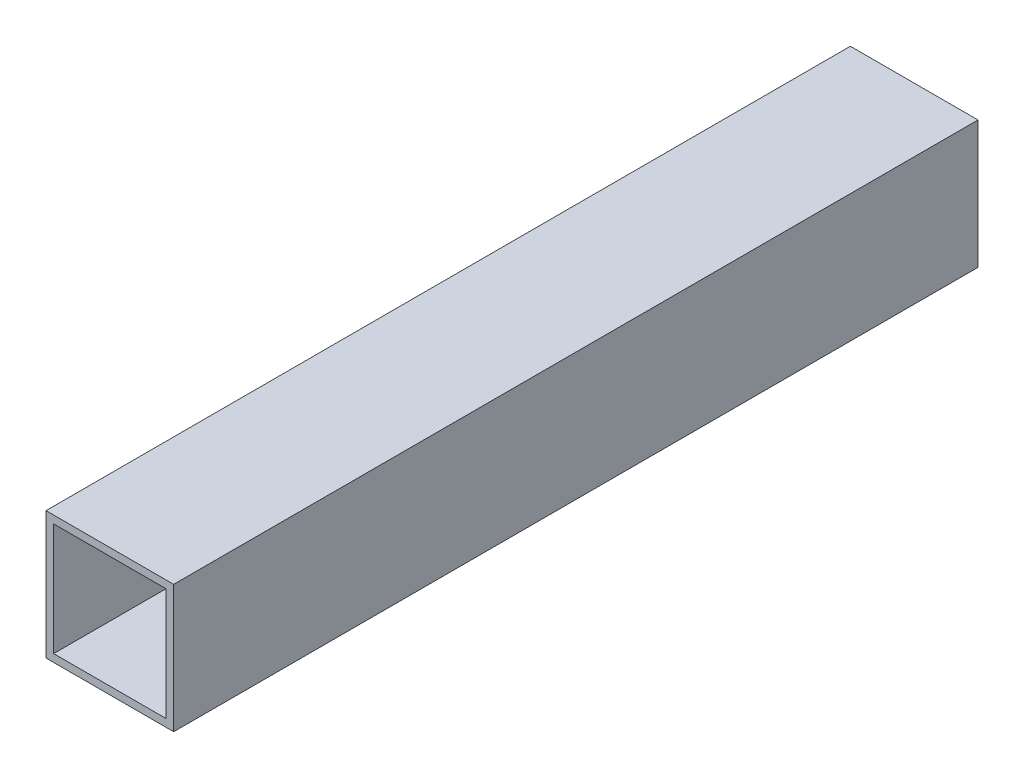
ISO-10303-21;
HEADER;
FILE_DESCRIPTION(('STEP AP214'),'2;1');
FILE_NAME('part.step','',(''),(''),'','','');
FILE_SCHEMA(('AUTOMOTIVE_DESIGN { 1 0 10303 214 1 1 1 1 }'));
ENDSEC;
DATA;
#1=APPLICATION_CONTEXT('core data for automotive mechanical design processes');
#2=APPLICATION_PROTOCOL_DEFINITION('international standard','automotive_design',2000,#1);
#3=PRODUCT_CONTEXT('',#1,'mechanical');
#4=PRODUCT('Part','Part','',(#3));
#5=PRODUCT_RELATED_PRODUCT_CATEGORY('part','',(#4));
#6=PRODUCT_DEFINITION_FORMATION('','',#4);
#7=PRODUCT_DEFINITION_CONTEXT('part definition',#1,'design');
#8=PRODUCT_DEFINITION('design','',#6,#7);
#9=PRODUCT_DEFINITION_SHAPE('','',#8);
#10=(LENGTH_UNIT() NAMED_UNIT(*) SI_UNIT(.MILLI.,.METRE.));
#11=(NAMED_UNIT(*) PLANE_ANGLE_UNIT() SI_UNIT($,.RADIAN.));
#12=(NAMED_UNIT(*) SI_UNIT($,.STERADIAN.) SOLID_ANGLE_UNIT());
#13=UNCERTAINTY_MEASURE_WITH_UNIT(LENGTH_MEASURE(1.E-05),#10,'distance_accuracy_value','');
#14=(GEOMETRIC_REPRESENTATION_CONTEXT(3) GLOBAL_UNCERTAINTY_ASSIGNED_CONTEXT((#13)) GLOBAL_UNIT_ASSIGNED_CONTEXT((#10,
#11,#12)) REPRESENTATION_CONTEXT('',''));
#15=CARTESIAN_POINT('',(0.,0.,0.));
#16=DIRECTION('',(0.,0.,1.));
#17=DIRECTION('',(1.,0.,0.));
#18=AXIS2_PLACEMENT_3D('',#15,#16,#17);
#19=CARTESIAN_POINT('',(0.,0.,630.));
#20=DIRECTION('',(0.,0.,1.));
#21=DIRECTION('',(1.,0.,0.));
#22=AXIS2_PLACEMENT_3D('',#19,#20,#21);
#23=PLANE('',#22);
#24=DIRECTION('',(0.,-1.,0.));
#25=VECTOR('',#24,1.);
#26=CARTESIAN_POINT('',(-44.,44.,630.));
#27=LINE('',#26,#25);
#28=CARTESIAN_POINT('',(-44.,44.,630.));
#29=VERTEX_POINT('',#28);
#30=CARTESIAN_POINT('',(-44.,-44.,630.));
#31=VERTEX_POINT('',#30);
#32=EDGE_CURVE('E24',#29,#31,#27,.T.);
#33=ORIENTED_EDGE('',*,*,#32,.F.);
#34=DIRECTION('',(-1.,0.,0.));
#35=VECTOR('',#34,1.);
#36=CARTESIAN_POINT('',(44.,44.,630.));
#37=LINE('',#36,#35);
#38=CARTESIAN_POINT('',(44.,44.,630.));
#39=VERTEX_POINT('',#38);
#40=EDGE_CURVE('E184',#39,#29,#37,.T.);
#41=ORIENTED_EDGE('',*,*,#40,.F.);
#42=DIRECTION('',(0.,1.,0.));
#43=VECTOR('',#42,1.);
#44=CARTESIAN_POINT('',(44.,-44.,630.));
#45=LINE('',#44,#43);
#46=CARTESIAN_POINT('',(44.,-44.,630.));
#47=VERTEX_POINT('',#46);
#48=EDGE_CURVE('E137',#47,#39,#45,.T.);
#49=ORIENTED_EDGE('',*,*,#48,.F.);
#50=DIRECTION('',(1.,0.,0.));
#51=VECTOR('',#50,1.);
#52=CARTESIAN_POINT('',(-44.,-44.,630.));
#53=LINE('',#52,#51);
#54=EDGE_CURVE('E147',#31,#47,#53,.T.);
#55=ORIENTED_EDGE('',*,*,#54,.F.);
#56=EDGE_LOOP('',(#33,#41,#49,#55));
#57=FACE_BOUND('',#56,.T.);
#58=DIRECTION('',(1.,0.,0.));
#59=VECTOR('',#58,1.);
#60=CARTESIAN_POINT('',(-50.,-50.,630.));
#61=LINE('',#60,#59);
#62=CARTESIAN_POINT('',(-50.,-50.,630.));
#63=VERTEX_POINT('',#62);
#64=CARTESIAN_POINT('',(50.,-50.,630.));
#65=VERTEX_POINT('',#64);
#66=EDGE_CURVE('E120',#63,#65,#61,.T.);
#67=ORIENTED_EDGE('',*,*,#66,.T.);
#68=DIRECTION('',(0.,1.,0.));
#69=VECTOR('',#68,1.);
#70=CARTESIAN_POINT('',(50.,-50.,630.));
#71=LINE('',#70,#69);
#72=CARTESIAN_POINT('',(50.,50.,630.));
#73=VERTEX_POINT('',#72);
#74=EDGE_CURVE('E152',#65,#73,#71,.T.);
#75=ORIENTED_EDGE('',*,*,#74,.T.);
#76=DIRECTION('',(-1.,0.,0.));
#77=VECTOR('',#76,1.);
#78=CARTESIAN_POINT('',(50.,50.,630.));
#79=LINE('',#78,#77);
#80=CARTESIAN_POINT('',(-50.,50.,630.));
#81=VERTEX_POINT('',#80);
#82=EDGE_CURVE('E112',#73,#81,#79,.T.);
#83=ORIENTED_EDGE('',*,*,#82,.T.);
#84=DIRECTION('',(0.,-1.,0.));
#85=VECTOR('',#84,1.);
#86=CARTESIAN_POINT('',(-50.,50.,630.));
#87=LINE('',#86,#85);
#88=EDGE_CURVE('E111',#81,#63,#87,.T.);
#89=ORIENTED_EDGE('',*,*,#88,.T.);
#90=EDGE_LOOP('',(#67,#75,#83,#89));
#91=FACE_BOUND('',#90,.T.);
#92=ADVANCED_FACE('F16',(#57,#91),#23,.T.);
#93=CARTESIAN_POINT('',(0.,0.,0.));
#94=DIRECTION('',(0.,0.,1.));
#95=DIRECTION('',(1.,0.,0.));
#96=AXIS2_PLACEMENT_3D('',#93,#94,#95);
#97=PLANE('',#96);
#98=DIRECTION('',(1.,0.,0.));
#99=VECTOR('',#98,1.);
#100=CARTESIAN_POINT('',(-44.,-44.,0.));
#101=LINE('',#100,#99);
#102=CARTESIAN_POINT('',(-44.,-44.,0.));
#103=VERTEX_POINT('',#102);
#104=CARTESIAN_POINT('',(44.,-44.,0.));
#105=VERTEX_POINT('',#104);
#106=EDGE_CURVE('E135',#103,#105,#101,.T.);
#107=ORIENTED_EDGE('',*,*,#106,.T.);
#108=DIRECTION('',(0.,1.,0.));
#109=VECTOR('',#108,1.);
#110=CARTESIAN_POINT('',(44.,-44.,0.));
#111=LINE('',#110,#109);
#112=CARTESIAN_POINT('',(44.,44.,0.));
#113=VERTEX_POINT('',#112);
#114=EDGE_CURVE('E180',#105,#113,#111,.T.);
#115=ORIENTED_EDGE('',*,*,#114,.T.);
#116=DIRECTION('',(-1.,0.,0.));
#117=VECTOR('',#116,1.);
#118=CARTESIAN_POINT('',(44.,44.,0.));
#119=LINE('',#118,#117);
#120=CARTESIAN_POINT('',(-44.,44.,0.));
#121=VERTEX_POINT('',#120);
#122=EDGE_CURVE('E191',#113,#121,#119,.T.);
#123=ORIENTED_EDGE('',*,*,#122,.T.);
#124=DIRECTION('',(0.,-1.,0.));
#125=VECTOR('',#124,1.);
#126=CARTESIAN_POINT('',(-44.,44.,0.));
#127=LINE('',#126,#125);
#128=EDGE_CURVE('E10',#121,#103,#127,.T.);
#129=ORIENTED_EDGE('',*,*,#128,.T.);
#130=EDGE_LOOP('',(#107,#115,#123,#129));
#131=FACE_BOUND('',#130,.T.);
#132=DIRECTION('',(0.,-1.,0.));
#133=VECTOR('',#132,1.);
#134=CARTESIAN_POINT('',(-50.,50.,0.));
#135=LINE('',#134,#133);
#136=CARTESIAN_POINT('',(-50.,50.,0.));
#137=VERTEX_POINT('',#136);
#138=CARTESIAN_POINT('',(-50.,-50.,0.));
#139=VERTEX_POINT('',#138);
#140=EDGE_CURVE('E100',#137,#139,#135,.T.);
#141=ORIENTED_EDGE('',*,*,#140,.F.);
#142=DIRECTION('',(-1.,0.,0.));
#143=VECTOR('',#142,1.);
#144=CARTESIAN_POINT('',(50.,50.,0.));
#145=LINE('',#144,#143);
#146=CARTESIAN_POINT('',(50.,50.,0.));
#147=VERTEX_POINT('',#146);
#148=EDGE_CURVE('E156',#147,#137,#145,.T.);
#149=ORIENTED_EDGE('',*,*,#148,.F.);
#150=DIRECTION('',(0.,1.,0.));
#151=VECTOR('',#150,1.);
#152=CARTESIAN_POINT('',(50.,-50.,0.));
#153=LINE('',#152,#151);
#154=CARTESIAN_POINT('',(50.,-50.,0.));
#155=VERTEX_POINT('',#154);
#156=EDGE_CURVE('E122',#155,#147,#153,.T.);
#157=ORIENTED_EDGE('',*,*,#156,.F.);
#158=DIRECTION('',(1.,0.,0.));
#159=VECTOR('',#158,1.);
#160=CARTESIAN_POINT('',(-50.,-50.,0.));
#161=LINE('',#160,#159);
#162=EDGE_CURVE('E118',#139,#155,#161,.T.);
#163=ORIENTED_EDGE('',*,*,#162,.F.);
#164=EDGE_LOOP('',(#141,#149,#157,#163));
#165=FACE_BOUND('',#164,.T.);
#166=ADVANCED_FACE('F124',(#131,#165),#97,.F.);
#167=CARTESIAN_POINT('',(-44.,44.,0.));
#168=DIRECTION('',(1.,0.,0.));
#169=DIRECTION('',(0.,1.,0.));
#170=AXIS2_PLACEMENT_3D('',#167,#168,#169);
#171=PLANE('',#170);
#172=DIRECTION('',(0.,0.,1.));
#173=VECTOR('',#172,1.);
#174=CARTESIAN_POINT('',(-44.,44.,0.));
#175=LINE('',#174,#173);
#176=EDGE_CURVE('E188',#121,#29,#175,.T.);
#177=ORIENTED_EDGE('',*,*,#176,.T.);
#178=ORIENTED_EDGE('',*,*,#32,.T.);
#179=DIRECTION('',(0.,0.,1.));
#180=VECTOR('',#179,1.);
#181=CARTESIAN_POINT('',(-44.,-44.,0.));
#182=LINE('',#181,#180);
#183=EDGE_CURVE('E166',#103,#31,#182,.T.);
#184=ORIENTED_EDGE('',*,*,#183,.F.);
#185=ORIENTED_EDGE('',*,*,#128,.F.);
#186=EDGE_LOOP('',(#177,#178,#184,#185));
#187=FACE_BOUND('',#186,.T.);
#188=ADVANCED_FACE('F195',(#187),#171,.T.);
#189=CARTESIAN_POINT('',(44.,44.,0.));
#190=DIRECTION('',(0.,-1.,0.));
#191=DIRECTION('',(0.,0.,-1.));
#192=AXIS2_PLACEMENT_3D('',#189,#190,#191);
#193=PLANE('',#192);
#194=DIRECTION('',(0.,0.,1.));
#195=VECTOR('',#194,1.);
#196=CARTESIAN_POINT('',(44.,44.,0.));
#197=LINE('',#196,#195);
#198=EDGE_CURVE('E176',#113,#39,#197,.T.);
#199=ORIENTED_EDGE('',*,*,#198,.T.);
#200=ORIENTED_EDGE('',*,*,#40,.T.);
#201=ORIENTED_EDGE('',*,*,#176,.F.);
#202=ORIENTED_EDGE('',*,*,#122,.F.);
#203=EDGE_LOOP('',(#199,#200,#201,#202));
#204=FACE_BOUND('',#203,.T.);
#205=ADVANCED_FACE('F205',(#204),#193,.T.);
#206=CARTESIAN_POINT('',(44.,-44.,0.));
#207=DIRECTION('',(-1.,0.,0.));
#208=DIRECTION('',(0.,0.,1.));
#209=AXIS2_PLACEMENT_3D('',#206,#207,#208);
#210=PLANE('',#209);
#211=DIRECTION('',(0.,0.,1.));
#212=VECTOR('',#211,1.);
#213=CARTESIAN_POINT('',(44.,-44.,0.));
#214=LINE('',#213,#212);
#215=EDGE_CURVE('E138',#105,#47,#214,.T.);
#216=ORIENTED_EDGE('',*,*,#215,.T.);
#217=ORIENTED_EDGE('',*,*,#48,.T.);
#218=ORIENTED_EDGE('',*,*,#198,.F.);
#219=ORIENTED_EDGE('',*,*,#114,.F.);
#220=EDGE_LOOP('',(#216,#217,#218,#219));
#221=FACE_BOUND('',#220,.T.);
#222=ADVANCED_FACE('F207',(#221),#210,.T.);
#223=CARTESIAN_POINT('',(-44.,-44.,0.));
#224=DIRECTION('',(0.,1.,0.));
#225=DIRECTION('',(1.,0.,0.));
#226=AXIS2_PLACEMENT_3D('',#223,#224,#225);
#227=PLANE('',#226);
#228=ORIENTED_EDGE('',*,*,#183,.T.);
#229=ORIENTED_EDGE('',*,*,#54,.T.);
#230=ORIENTED_EDGE('',*,*,#215,.F.);
#231=ORIENTED_EDGE('',*,*,#106,.F.);
#232=EDGE_LOOP('',(#228,#229,#230,#231));
#233=FACE_BOUND('',#232,.T.);
#234=ADVANCED_FACE('F201',(#233),#227,.T.);
#235=CARTESIAN_POINT('',(-50.,50.,0.));
#236=DIRECTION('',(1.,0.,0.));
#237=DIRECTION('',(0.,1.,0.));
#238=AXIS2_PLACEMENT_3D('',#235,#236,#237);
#239=PLANE('',#238);
#240=ORIENTED_EDGE('',*,*,#140,.T.);
#241=DIRECTION('',(0.,0.,1.));
#242=VECTOR('',#241,1.);
#243=CARTESIAN_POINT('',(-50.,-50.,0.));
#244=LINE('',#243,#242);
#245=EDGE_CURVE('E103',#139,#63,#244,.T.);
#246=ORIENTED_EDGE('',*,*,#245,.T.);
#247=ORIENTED_EDGE('',*,*,#88,.F.);
#248=DIRECTION('',(0.,0.,1.));
#249=VECTOR('',#248,1.);
#250=CARTESIAN_POINT('',(-50.,50.,0.));
#251=LINE('',#250,#249);
#252=EDGE_CURVE('E106',#137,#81,#251,.T.);
#253=ORIENTED_EDGE('',*,*,#252,.F.);
#254=EDGE_LOOP('',(#240,#246,#247,#253));
#255=FACE_BOUND('',#254,.T.);
#256=ADVANCED_FACE('F102',(#255),#239,.F.);
#257=CARTESIAN_POINT('',(50.,50.,0.));
#258=DIRECTION('',(0.,-1.,0.));
#259=DIRECTION('',(0.,0.,-1.));
#260=AXIS2_PLACEMENT_3D('',#257,#258,#259);
#261=PLANE('',#260);
#262=ORIENTED_EDGE('',*,*,#148,.T.);
#263=ORIENTED_EDGE('',*,*,#252,.T.);
#264=ORIENTED_EDGE('',*,*,#82,.F.);
#265=DIRECTION('',(0.,0.,1.));
#266=VECTOR('',#265,1.);
#267=CARTESIAN_POINT('',(50.,50.,0.));
#268=LINE('',#267,#266);
#269=EDGE_CURVE('E144',#147,#73,#268,.T.);
#270=ORIENTED_EDGE('',*,*,#269,.F.);
#271=EDGE_LOOP('',(#262,#263,#264,#270));
#272=FACE_BOUND('',#271,.T.);
#273=ADVANCED_FACE('F258',(#272),#261,.F.);
#274=CARTESIAN_POINT('',(50.,-50.,0.));
#275=DIRECTION('',(-1.,0.,0.));
#276=DIRECTION('',(0.,0.,1.));
#277=AXIS2_PLACEMENT_3D('',#274,#275,#276);
#278=PLANE('',#277);
#279=ORIENTED_EDGE('',*,*,#156,.T.);
#280=ORIENTED_EDGE('',*,*,#269,.T.);
#281=ORIENTED_EDGE('',*,*,#74,.F.);
#282=DIRECTION('',(0.,0.,1.));
#283=VECTOR('',#282,1.);
#284=CARTESIAN_POINT('',(50.,-50.,0.));
#285=LINE('',#284,#283);
#286=EDGE_CURVE('E128',#155,#65,#285,.T.);
#287=ORIENTED_EDGE('',*,*,#286,.F.);
#288=EDGE_LOOP('',(#279,#280,#281,#287));
#289=FACE_BOUND('',#288,.T.);
#290=ADVANCED_FACE('F267',(#289),#278,.F.);
#291=CARTESIAN_POINT('',(-50.,-50.,0.));
#292=DIRECTION('',(0.,1.,0.));
#293=DIRECTION('',(1.,0.,0.));
#294=AXIS2_PLACEMENT_3D('',#291,#292,#293);
#295=PLANE('',#294);
#296=ORIENTED_EDGE('',*,*,#162,.T.);
#297=ORIENTED_EDGE('',*,*,#286,.T.);
#298=ORIENTED_EDGE('',*,*,#66,.F.);
#299=ORIENTED_EDGE('',*,*,#245,.F.);
#300=EDGE_LOOP('',(#296,#297,#298,#299));
#301=FACE_BOUND('',#300,.T.);
#302=ADVANCED_FACE('F116',(#301),#295,.F.);
#303=CLOSED_SHELL('',(#92,#166,#188,#205,#222,#234,#256,#273,#290,#302));
#304=MANIFOLD_SOLID_BREP('B1',#303);
#305=ADVANCED_BREP_SHAPE_REPRESENTATION('',(#18,#304),#14);
#306=SHAPE_DEFINITION_REPRESENTATION(#9,#305);
ENDSEC;
END-ISO-10303-21;
